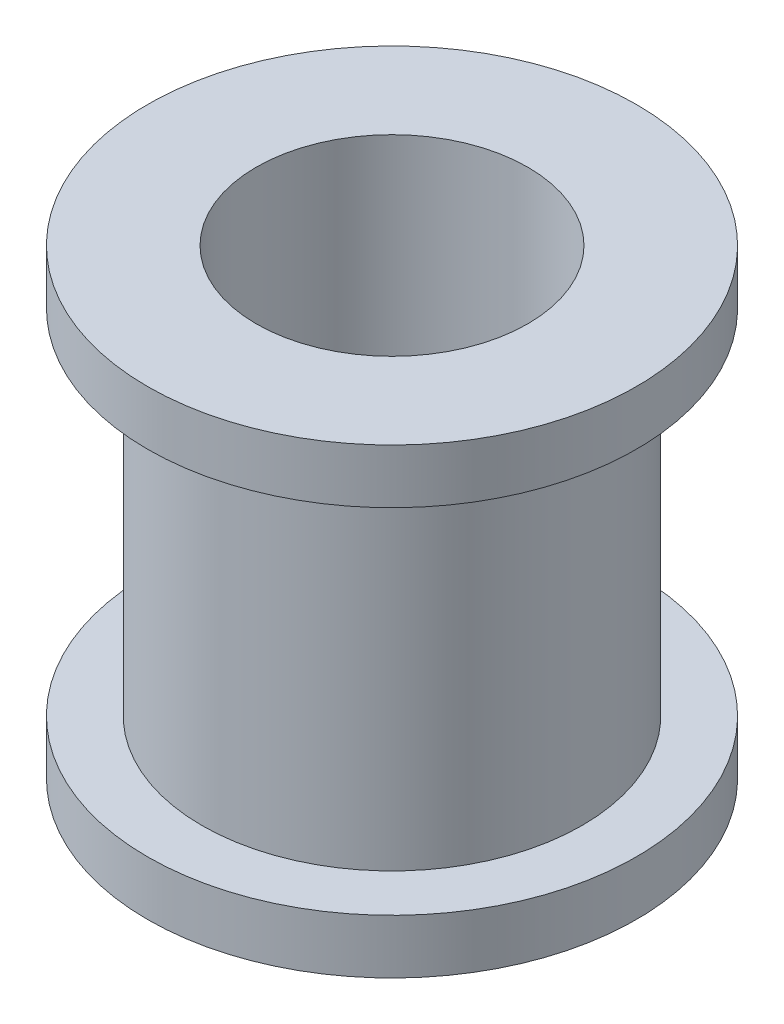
from build123d import *

# Parameters (mm, degrees)
TROU_TARAUD_M6X1_01_D = 5


with BuildPart() as part:
    # Esquisse1 → Base-R_volution (revolve)
    with BuildSketch(Plane.XY, mode=Mode.PRIVATE) as base_r_volution_sk:
        Polygon((-20, 205), (-20, 203), (-22, 203), (-22, 190), (-20, 190), (-20, 188), (-22.75, 188), (-22.75, 189.5), (-29, 189.5), (-29, 195.5), (-24, 195.5), (-24, 205), align=None)
    revolve(base_r_volution_sk.sketch.rotate(Axis((-29, 179, 0), (0, 1, 0)), 90), axis=Axis((-29, 179, 0), (0, 1, 0)))

    # Trou taraud_ M6x1.01 (through all)
    with Locations(Plane(origin=(0, 195.5, 0), x_dir=(-1, 0, 0), z_dir=(0, 1, 0))):
        with Locations((29, 0)):
            Hole(TROU_TARAUD_M6X1_01_D / 2)


solid = part.part
